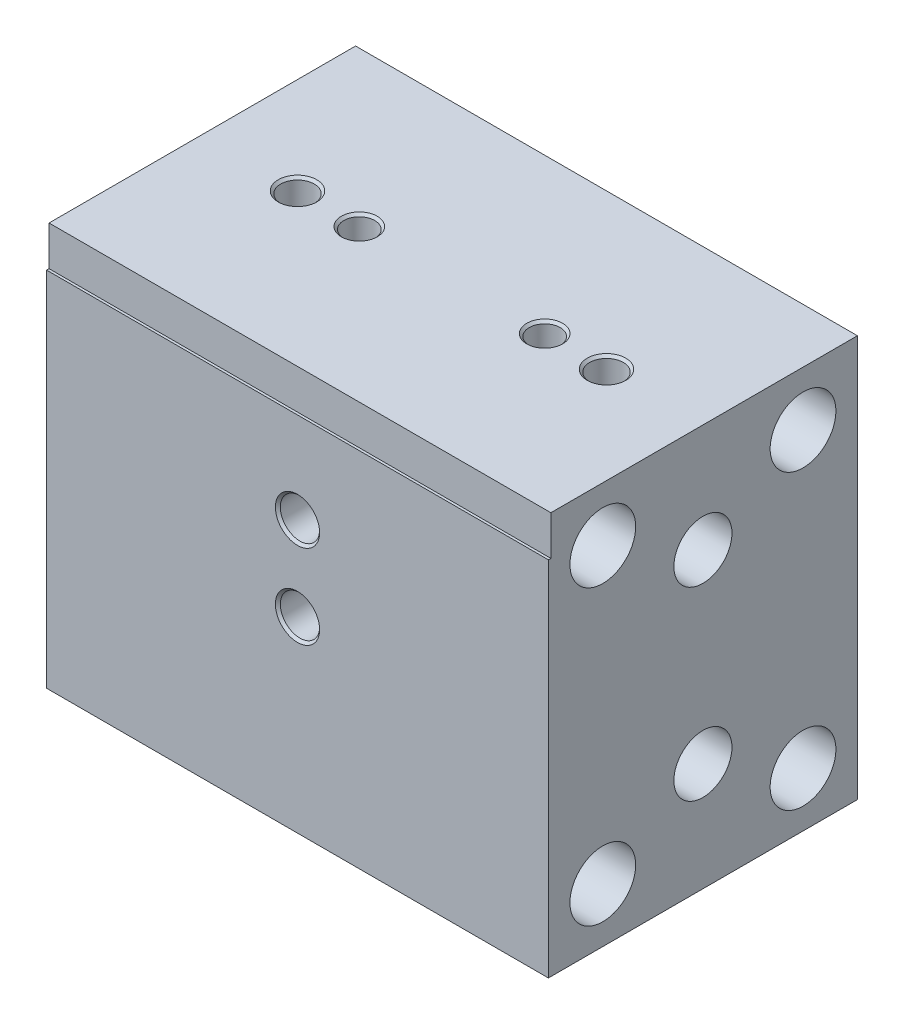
from build123d import *

# Parameters (mm, degrees)
SKETCH1_W                  = 51.562
SKETCH1_H                  = 41.275
EXTRUDE1_DEPTH             = 15.875
SKETCH18_W                 = 0.254
SKETCH18_H                 = 4.064
CUT_EXTRUDE1_DEPTH         = 51.562
F_8_32_TAPPED_HOLE1_D      = 3.4544
F_8_32_TAPPED_HOLE1_DEPTH  = 10.3124
F_8_32_TAPPED_HOLE1_TIP    = 1.037806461
HOLE1_D                    = 3.175
HOLE1_DEPTH                = 6.35
HOLE1_TIP                  = 0.953866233
F_10_32_TAPPED_HOLE1_D     = 4.0386
F_10_32_TAPPED_HOLE1_DEPTH = 9.5504
F_10_32_TAPPED_HOLE1_TIP   = 1.213317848
F_8_32_TAPPED_HOLE2_D      = 3.4544
F_8_32_TAPPED_HOLE2_DEPTH  = 10.3124
F_8_32_TAPPED_HOLE2_TIP    = 1.037806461
HOLE2_D                    = 3.175
HOLE2_DEPTH                = 6.35
HOLE2_TIP                  = 0.953866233
SKETCH29_R                 = 3.3782
SKETCH29_R_2               = 2.9845
CUT_EXTRUDE2_DEPTH         = 58.762980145
CHAMFER1_SIZE              = 0.254


with BuildPart() as part:
    # Sketch1 → Extrude1 (new, symmetric)
    with BuildSketch(Plane.XY):
        Rectangle(SKETCH1_W, SKETCH1_H)
    extrude(amount=EXTRUDE1_DEPTH, both=True)

    # Sketch18 → Cut-Extrude1 (cut)
    with BuildSketch(Plane(origin=(25.781, 0, 0), x_dir=(0, 0, -1), z_dir=(1, 0, 0))):
        with Locations((-15.748, 18.6055)):
            Rectangle(SKETCH18_W, SKETCH18_H)
    extrude(amount=-CUT_EXTRUDE1_DEPTH, mode=Mode.SUBTRACT)

    # 8-32 Tapped Hole1
    with Locations(Plane(origin=(0, 20.6375, 0), x_dir=(1, 0, 0), z_dir=(0, 1, 0))):
        with Locations((-15.875, 0), (15.875, 0)):
            Hole(F_8_32_TAPPED_HOLE1_D / 2, depth=F_8_32_TAPPED_HOLE1_DEPTH)
            with Locations((0, 0, -(F_8_32_TAPPED_HOLE1_DEPTH + F_8_32_TAPPED_HOLE1_TIP / 2))):  # 118° drill point
                Cone(0, F_8_32_TAPPED_HOLE1_D / 2, F_8_32_TAPPED_HOLE1_TIP, mode=Mode.SUBTRACT)

    # Hole1
    with Locations(Plane(origin=(0, 20.6375, 0), x_dir=(1, 0, 0), z_dir=(0, 1, 0))):
        with Locations((-9.525, 0), (9.525, 0)):
            Hole(HOLE1_D / 2, depth=HOLE1_DEPTH)
            with Locations((0, 0, -(HOLE1_DEPTH + HOLE1_TIP / 2))):  # 118° drill point
                Cone(0, HOLE1_D / 2, HOLE1_TIP, mode=Mode.SUBTRACT)

    # 10-32 Tapped Hole1
    with Locations(Plane.XY.offset(15.875)):
        with Locations((0, 7.239), (0, -1.397)):
            Hole(F_10_32_TAPPED_HOLE1_D / 2, depth=F_10_32_TAPPED_HOLE1_DEPTH)
            with Locations((0, 0, -(F_10_32_TAPPED_HOLE1_DEPTH + F_10_32_TAPPED_HOLE1_TIP / 2))):  # 118° drill point
                Cone(0, F_10_32_TAPPED_HOLE1_D / 2, F_10_32_TAPPED_HOLE1_TIP, mode=Mode.SUBTRACT)

    # 8-32 Tapped Hole2
    with Locations(Plane(origin=(0, 0, -15.875), x_dir=(-1, 0, 0), z_dir=(0, 0, -1))):
        with Locations((-15.875, 0), (15.875, 0)):
            Hole(F_8_32_TAPPED_HOLE2_D / 2, depth=F_8_32_TAPPED_HOLE2_DEPTH)
            with Locations((0, 0, -(F_8_32_TAPPED_HOLE2_DEPTH + F_8_32_TAPPED_HOLE2_TIP / 2))):  # 118° drill point
                Cone(0, F_8_32_TAPPED_HOLE2_D / 2, F_8_32_TAPPED_HOLE2_TIP, mode=Mode.SUBTRACT)

    # Hole2
    with Locations(Plane(origin=(0, 0, -15.875), x_dir=(-1, 0, 0), z_dir=(0, 0, -1))):
        with Locations((-9.525, 0), (9.525, 0)):
            Hole(HOLE2_D / 2, depth=HOLE2_DEPTH)
            with Locations((0, 0, -(HOLE2_DEPTH + HOLE2_TIP / 2))):  # 118° drill point
                Cone(0, HOLE2_D / 2, HOLE2_TIP, mode=Mode.SUBTRACT)

    # Sketch29 → Cut-Extrude2 (cut, through all)
    with BuildSketch(Plane(origin=(25.781, 0, 0), x_dir=(0, 0, -1), z_dir=(1, 0, 0))):
        with Locations((-10.287, 15.0495)):
            Circle(SKETCH29_R)
        with Locations((10.287, 15.0495)):
            Circle(SKETCH29_R)
        with Locations((-10.287, -15.0495)):
            Circle(SKETCH29_R)
        with Locations((10.287, -15.0495)):
            Circle(SKETCH29_R)
        with Locations((0, 9.525)):
            Circle(SKETCH29_R_2)
        with Locations((0, -9.525)):
            Circle(SKETCH29_R_2)
    extrude(amount=-CUT_EXTRUDE2_DEPTH, mode=Mode.SUBTRACT)

    # Chamfer1
    chamfer1_edges = [part.edges().sort_by_distance(p)[0] for p in [
        (17.6022, 20.6375, 0),
        (-14.1478, 20.6375, 0),
        (11.1125, 20.6375, 0),
        (-7.9375, 20.6375, 0),
        (2.0193, -1.397, 15.875),
        (2.0193, 7.239, 15.875),
        (-17.6022, 0, -15.875),
        (14.1478, 0, -15.875),
        (-11.1125, 0, -15.875),
        (7.9375, 0, -15.875),
    ]]
    chamfer(chamfer1_edges, length=CHAMFER1_SIZE)


solid = part.part
